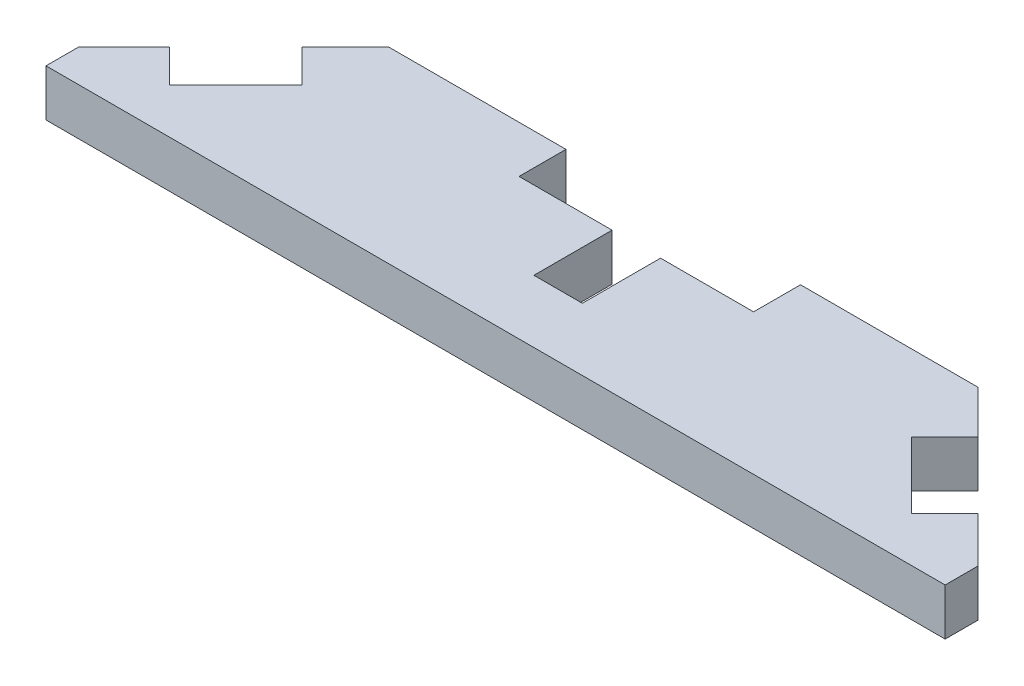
ISO-10303-21;
HEADER;
FILE_DESCRIPTION(('STEP AP214'),'2;1');
FILE_NAME('part.step','',(''),(''),'','','');
FILE_SCHEMA(('AUTOMOTIVE_DESIGN { 1 0 10303 214 1 1 1 1 }'));
ENDSEC;
DATA;
#1=APPLICATION_CONTEXT('core data for automotive mechanical design processes');
#2=APPLICATION_PROTOCOL_DEFINITION('international standard','automotive_design',2000,#1);
#3=PRODUCT_CONTEXT('',#1,'mechanical');
#4=PRODUCT('Part','Part','',(#3));
#5=PRODUCT_RELATED_PRODUCT_CATEGORY('part','',(#4));
#6=PRODUCT_DEFINITION_FORMATION('','',#4);
#7=PRODUCT_DEFINITION_CONTEXT('part definition',#1,'design');
#8=PRODUCT_DEFINITION('design','',#6,#7);
#9=PRODUCT_DEFINITION_SHAPE('','',#8);
#10=(LENGTH_UNIT() NAMED_UNIT(*) SI_UNIT(.MILLI.,.METRE.));
#11=(NAMED_UNIT(*) PLANE_ANGLE_UNIT() SI_UNIT($,.RADIAN.));
#12=(NAMED_UNIT(*) SI_UNIT($,.STERADIAN.) SOLID_ANGLE_UNIT());
#13=UNCERTAINTY_MEASURE_WITH_UNIT(LENGTH_MEASURE(1.E-05),#10,'distance_accuracy_value','');
#14=(GEOMETRIC_REPRESENTATION_CONTEXT(3) GLOBAL_UNCERTAINTY_ASSIGNED_CONTEXT((#13)) GLOBAL_UNIT_ASSIGNED_CONTEXT((#10,
#11,#12)) REPRESENTATION_CONTEXT('',''));
#15=CARTESIAN_POINT('',(0.,0.,0.));
#16=DIRECTION('',(0.,0.,1.));
#17=DIRECTION('',(1.,0.,0.));
#18=AXIS2_PLACEMENT_3D('',#15,#16,#17);
#19=CARTESIAN_POINT('',(-1.97758476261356E-13,3.,-24.85));
#20=DIRECTION('',(0.,-1.,0.));
#21=DIRECTION('',(0.,0.,-1.));
#22=AXIS2_PLACEMENT_3D('',#19,#20,#21);
#23=PLANE('',#22);
#24=DIRECTION('',(0.,0.,1.));
#25=VECTOR('',#24,1.);
#26=CARTESIAN_POINT('',(28.7499999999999,3.,5.99999999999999));
#27=LINE('',#26,#25);
#28=CARTESIAN_POINT('',(28.7499999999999,3.,3.89999999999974));
#29=VERTEX_POINT('',#28);
#30=CARTESIAN_POINT('',(28.7499999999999,3.,5.99999999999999));
#31=VERTEX_POINT('',#30);
#32=EDGE_CURVE('E181',#29,#31,#27,.T.);
#33=ORIENTED_EDGE('',*,*,#32,.F.);
#34=DIRECTION('',(-0.707106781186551,0.,-0.707106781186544));
#35=VECTOR('',#34,1.);
#36=CARTESIAN_POINT('',(18.85,3.,-6.00000000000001));
#37=LINE('',#36,#35);
#38=CARTESIAN_POINT('',(25.8503571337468,3.,1.00035713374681));
#39=VERTEX_POINT('',#38);
#40=EDGE_CURVE('E297',#29,#39,#37,.T.);
#41=ORIENTED_EDGE('',*,*,#40,.T.);
#42=DIRECTION('',(0.707106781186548,0.,-0.707106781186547));
#43=VECTOR('',#42,1.);
#44=CARTESIAN_POINT('',(25.8503571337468,3.,1.00035713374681));
#45=LINE('',#44,#43);
#46=CARTESIAN_POINT('',(23.7290367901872,3.,3.12167747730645));
#47=VERTEX_POINT('',#46);
#48=EDGE_CURVE('E358',#47,#39,#45,.T.);
#49=ORIENTED_EDGE('',*,*,#48,.F.);
#50=DIRECTION('',(0.707106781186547,0.,0.707106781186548));
#51=VECTOR('',#50,1.);
#52=CARTESIAN_POINT('',(23.7290367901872,3.,3.12167747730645));
#53=LINE('',#52,#51);
#54=CARTESIAN_POINT('',(19.4863961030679,3.,-1.12096320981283));
#55=VERTEX_POINT('',#54);
#56=EDGE_CURVE('E364',#55,#47,#53,.T.);
#57=ORIENTED_EDGE('',*,*,#56,.F.);
#58=DIRECTION('',(-0.707106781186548,0.,0.707106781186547));
#59=VECTOR('',#58,1.);
#60=CARTESIAN_POINT('',(21.6077164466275,3.,-3.24228355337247));
#61=LINE('',#60,#59);
#62=CARTESIAN_POINT('',(21.6077164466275,3.,-3.24228355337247));
#63=VERTEX_POINT('',#62);
#64=EDGE_CURVE('E361',#63,#55,#61,.T.);
#65=ORIENTED_EDGE('',*,*,#64,.F.);
#66=CARTESIAN_POINT('',(18.85,3.,-6.00000000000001));
#67=VERTEX_POINT('',#66);
#68=EDGE_CURVE('E222',#63,#67,#37,.T.);
#69=ORIENTED_EDGE('',*,*,#68,.T.);
#70=DIRECTION('',(-1.,0.,0.));
#71=VECTOR('',#70,1.);
#72=CARTESIAN_POINT('',(-18.85,3.,-6.00000000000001));
#73=LINE('',#72,#71);
#74=CARTESIAN_POINT('',(7.5,3.,-6.00000000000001));
#75=VERTEX_POINT('',#74);
#76=EDGE_CURVE('E299',#67,#75,#73,.T.);
#77=ORIENTED_EDGE('',*,*,#76,.T.);
#78=DIRECTION('',(0.,0.,-1.));
#79=VECTOR('',#78,1.);
#80=CARTESIAN_POINT('',(7.5,3.,-3.00000000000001));
#81=LINE('',#80,#79);
#82=CARTESIAN_POINT('',(7.5,3.,-3.00000000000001));
#83=VERTEX_POINT('',#82);
#84=EDGE_CURVE('E245',#83,#75,#81,.T.);
#85=ORIENTED_EDGE('',*,*,#84,.F.);
#86=DIRECTION('',(1.,0.,0.));
#87=VECTOR('',#86,1.);
#88=CARTESIAN_POINT('',(-7.5,3.,-3.00000000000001));
#89=LINE('',#88,#87);
#90=CARTESIAN_POINT('',(1.55,3.,-3.00000000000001));
#91=VERTEX_POINT('',#90);
#92=EDGE_CURVE('E234',#91,#83,#89,.T.);
#93=ORIENTED_EDGE('',*,*,#92,.F.);
#94=DIRECTION('',(0.,0.,-1.));
#95=VECTOR('',#94,1.);
#96=CARTESIAN_POINT('',(1.55,3.,-24.85));
#97=LINE('',#96,#95);
#98=CARTESIAN_POINT('',(1.55,3.,1.99999999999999));
#99=VERTEX_POINT('',#98);
#100=EDGE_CURVE('E243',#99,#91,#97,.T.);
#101=ORIENTED_EDGE('',*,*,#100,.F.);
#102=DIRECTION('',(1.,0.,0.));
#103=VECTOR('',#102,1.);
#104=CARTESIAN_POINT('',(-1.97758476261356E-13,3.,1.99999999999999));
#105=LINE('',#104,#103);
#106=CARTESIAN_POINT('',(-1.55,3.,1.99999999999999));
#107=VERTEX_POINT('',#106);
#108=EDGE_CURVE('E355',#107,#99,#105,.T.);
#109=ORIENTED_EDGE('',*,*,#108,.F.);
#110=DIRECTION('',(0.,0.,1.));
#111=VECTOR('',#110,1.);
#112=CARTESIAN_POINT('',(-1.55,3.,-24.85));
#113=LINE('',#112,#111);
#114=CARTESIAN_POINT('',(-1.55,3.,-3.00000000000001));
#115=VERTEX_POINT('',#114);
#116=EDGE_CURVE('E352',#115,#107,#113,.T.);
#117=ORIENTED_EDGE('',*,*,#116,.F.);
#118=CARTESIAN_POINT('',(-7.5,3.,-3.00000000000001));
#119=VERTEX_POINT('',#118);
#120=EDGE_CURVE('E246',#119,#115,#89,.T.);
#121=ORIENTED_EDGE('',*,*,#120,.F.);
#122=DIRECTION('',(0.,0.,1.));
#123=VECTOR('',#122,1.);
#124=CARTESIAN_POINT('',(-7.5,3.,-3.00000000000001));
#125=LINE('',#124,#123);
#126=CARTESIAN_POINT('',(-7.5,3.,-6.00000000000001));
#127=VERTEX_POINT('',#126);
#128=EDGE_CURVE('E247',#127,#119,#125,.T.);
#129=ORIENTED_EDGE('',*,*,#128,.F.);
#130=CARTESIAN_POINT('',(-18.85,3.,-6.00000000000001));
#131=VERTEX_POINT('',#130);
#132=EDGE_CURVE('E298',#127,#131,#73,.T.);
#133=ORIENTED_EDGE('',*,*,#132,.T.);
#134=DIRECTION('',(-0.707106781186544,0.,0.707106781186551));
#135=VECTOR('',#134,1.);
#136=CARTESIAN_POINT('',(-18.85,3.,-6.00000000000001));
#137=LINE('',#136,#135);
#138=CARTESIAN_POINT('',(-21.6077164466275,3.,-3.24228355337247));
#139=VERTEX_POINT('',#138);
#140=EDGE_CURVE('E201',#131,#139,#137,.T.);
#141=ORIENTED_EDGE('',*,*,#140,.T.);
#142=DIRECTION('',(-0.707106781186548,0.,-0.707106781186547));
#143=VECTOR('',#142,1.);
#144=CARTESIAN_POINT('',(-21.6077164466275,3.,-3.24228355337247));
#145=LINE('',#144,#143);
#146=CARTESIAN_POINT('',(-19.4863961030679,3.,-1.12096320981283));
#147=VERTEX_POINT('',#146);
#148=EDGE_CURVE('E278',#147,#139,#145,.T.);
#149=ORIENTED_EDGE('',*,*,#148,.F.);
#150=DIRECTION('',(0.707106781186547,0.,-0.707106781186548));
#151=VECTOR('',#150,1.);
#152=CARTESIAN_POINT('',(-23.7290367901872,3.,3.12167747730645));
#153=LINE('',#152,#151);
#154=CARTESIAN_POINT('',(-23.7290367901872,3.,3.12167747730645));
#155=VERTEX_POINT('',#154);
#156=EDGE_CURVE('E275',#155,#147,#153,.T.);
#157=ORIENTED_EDGE('',*,*,#156,.F.);
#158=DIRECTION('',(0.707106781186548,0.,0.707106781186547));
#159=VECTOR('',#158,1.);
#160=CARTESIAN_POINT('',(-25.8503571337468,3.,1.00035713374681));
#161=LINE('',#160,#159);
#162=CARTESIAN_POINT('',(-25.8503571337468,3.,1.00035713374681));
#163=VERTEX_POINT('',#162);
#164=EDGE_CURVE('E273',#163,#155,#161,.T.);
#165=ORIENTED_EDGE('',*,*,#164,.F.);
#166=CARTESIAN_POINT('',(-28.7499999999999,3.,3.89999999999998));
#167=VERTEX_POINT('',#166);
#168=EDGE_CURVE('E207',#163,#167,#137,.T.);
#169=ORIENTED_EDGE('',*,*,#168,.T.);
#170=DIRECTION('',(0.,0.,-1.));
#171=VECTOR('',#170,1.);
#172=CARTESIAN_POINT('',(-28.7499999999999,3.,6.));
#173=LINE('',#172,#171);
#174=CARTESIAN_POINT('',(-28.7499999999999,3.,6.));
#175=VERTEX_POINT('',#174);
#176=EDGE_CURVE('E199',#175,#167,#173,.T.);
#177=ORIENTED_EDGE('',*,*,#176,.F.);
#178=DIRECTION('',(1.,0.,0.));
#179=VECTOR('',#178,1.);
#180=CARTESIAN_POINT('',(-29.9499999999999,3.,6.));
#181=LINE('',#180,#179);
#182=EDGE_CURVE('E193',#175,#31,#181,.T.);
#183=ORIENTED_EDGE('',*,*,#182,.T.);
#184=EDGE_LOOP('',(#33,#41,#49,#57,#65,#69,#77,#85,#93,#101,#109,#117,#121,#129,#133,#141,#149,
#157,#165,#169,#177,#183));
#185=FACE_BOUND('',#184,.T.);
#186=ADVANCED_FACE('F35',(#185),#23,.F.);
#187=CARTESIAN_POINT('',(-1.97758476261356E-13,0.,-24.85));
#188=DIRECTION('',(0.,-1.,0.));
#189=DIRECTION('',(0.,0.,-1.));
#190=AXIS2_PLACEMENT_3D('',#187,#188,#189);
#191=PLANE('',#190);
#192=DIRECTION('',(-0.707106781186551,0.,-0.707106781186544));
#193=VECTOR('',#192,1.);
#194=CARTESIAN_POINT('',(18.85,0.,-6.00000000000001));
#195=LINE('',#194,#193);
#196=CARTESIAN_POINT('',(28.7499999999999,0.,3.89999999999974));
#197=VERTEX_POINT('',#196);
#198=CARTESIAN_POINT('',(25.8503571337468,0.,1.00035713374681));
#199=VERTEX_POINT('',#198);
#200=EDGE_CURVE('E211',#197,#199,#195,.T.);
#201=ORIENTED_EDGE('',*,*,#200,.F.);
#202=DIRECTION('',(0.,0.,1.));
#203=VECTOR('',#202,1.);
#204=CARTESIAN_POINT('',(28.7499999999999,0.,5.99999999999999));
#205=LINE('',#204,#203);
#206=CARTESIAN_POINT('',(28.7499999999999,0.,5.99999999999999));
#207=VERTEX_POINT('',#206);
#208=EDGE_CURVE('E49',#197,#207,#205,.T.);
#209=ORIENTED_EDGE('',*,*,#208,.T.);
#210=DIRECTION('',(1.,0.,0.));
#211=VECTOR('',#210,1.);
#212=CARTESIAN_POINT('',(29.9500000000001,0.,6.));
#213=LINE('',#212,#211);
#214=CARTESIAN_POINT('',(-28.7499999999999,0.,5.99999999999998));
#215=VERTEX_POINT('',#214);
#216=EDGE_CURVE('E195',#215,#207,#213,.T.);
#217=ORIENTED_EDGE('',*,*,#216,.F.);
#218=DIRECTION('',(0.,0.,-1.));
#219=VECTOR('',#218,1.);
#220=CARTESIAN_POINT('',(-28.7499999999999,0.,6.));
#221=LINE('',#220,#219);
#222=CARTESIAN_POINT('',(-28.7499999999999,0.,3.89999999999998));
#223=VERTEX_POINT('',#222);
#224=EDGE_CURVE('E57',#215,#223,#221,.T.);
#225=ORIENTED_EDGE('',*,*,#224,.T.);
#226=DIRECTION('',(-0.707106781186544,0.,0.707106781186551));
#227=VECTOR('',#226,1.);
#228=CARTESIAN_POINT('',(-18.85,0.,-6.00000000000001));
#229=LINE('',#228,#227);
#230=CARTESIAN_POINT('',(-25.8503571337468,0.,1.00035713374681));
#231=VERTEX_POINT('',#230);
#232=EDGE_CURVE('E218',#231,#223,#229,.T.);
#233=ORIENTED_EDGE('',*,*,#232,.F.);
#234=DIRECTION('',(0.707106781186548,0.,0.707106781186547));
#235=VECTOR('',#234,1.);
#236=CARTESIAN_POINT('',(-25.8503571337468,0.,1.00035713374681));
#237=LINE('',#236,#235);
#238=CARTESIAN_POINT('',(-23.7290367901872,0.,3.12167747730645));
#239=VERTEX_POINT('',#238);
#240=EDGE_CURVE('E272',#231,#239,#237,.T.);
#241=ORIENTED_EDGE('',*,*,#240,.T.);
#242=DIRECTION('',(0.707106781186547,0.,-0.707106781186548));
#243=VECTOR('',#242,1.);
#244=CARTESIAN_POINT('',(-23.7290367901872,0.,3.12167747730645));
#245=LINE('',#244,#243);
#246=CARTESIAN_POINT('',(-19.4863961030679,0.,-1.12096320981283));
#247=VERTEX_POINT('',#246);
#248=EDGE_CURVE('E283',#239,#247,#245,.T.);
#249=ORIENTED_EDGE('',*,*,#248,.T.);
#250=DIRECTION('',(-0.707106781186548,0.,-0.707106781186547));
#251=VECTOR('',#250,1.);
#252=CARTESIAN_POINT('',(-21.6077164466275,0.,-3.24228355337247));
#253=LINE('',#252,#251);
#254=CARTESIAN_POINT('',(-21.6077164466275,0.,-3.24228355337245));
#255=VERTEX_POINT('',#254);
#256=EDGE_CURVE('E276',#247,#255,#253,.T.);
#257=ORIENTED_EDGE('',*,*,#256,.T.);
#258=CARTESIAN_POINT('',(-18.85,0.,-6.00000000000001));
#259=VERTEX_POINT('',#258);
#260=EDGE_CURVE('E219',#259,#255,#229,.T.);
#261=ORIENTED_EDGE('',*,*,#260,.F.);
#262=DIRECTION('',(-1.,0.,0.));
#263=VECTOR('',#262,1.);
#264=CARTESIAN_POINT('',(-18.85,0.,-6.00000000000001));
#265=LINE('',#264,#263);
#266=CARTESIAN_POINT('',(-7.5,0.,-6.00000000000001));
#267=VERTEX_POINT('',#266);
#268=EDGE_CURVE('E213',#267,#259,#265,.T.);
#269=ORIENTED_EDGE('',*,*,#268,.F.);
#270=DIRECTION('',(0.,0.,1.));
#271=VECTOR('',#270,1.);
#272=CARTESIAN_POINT('',(-7.5,0.,-3.00000000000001));
#273=LINE('',#272,#271);
#274=CARTESIAN_POINT('',(-7.5,0.,-3.00000000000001));
#275=VERTEX_POINT('',#274);
#276=EDGE_CURVE('E257',#267,#275,#273,.T.);
#277=ORIENTED_EDGE('',*,*,#276,.T.);
#278=DIRECTION('',(1.,0.,0.));
#279=VECTOR('',#278,1.);
#280=CARTESIAN_POINT('',(-7.5,0.,-3.00000000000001));
#281=LINE('',#280,#279);
#282=CARTESIAN_POINT('',(-1.55,0.,-3.00000000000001));
#283=VERTEX_POINT('',#282);
#284=EDGE_CURVE('E261',#275,#283,#281,.T.);
#285=ORIENTED_EDGE('',*,*,#284,.T.);
#286=DIRECTION('',(0.,0.,1.));
#287=VECTOR('',#286,1.);
#288=CARTESIAN_POINT('',(-1.55,0.,1.99999999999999));
#289=LINE('',#288,#287);
#290=CARTESIAN_POINT('',(-1.55,0.,1.99999999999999));
#291=VERTEX_POINT('',#290);
#292=EDGE_CURVE('E338',#283,#291,#289,.T.);
#293=ORIENTED_EDGE('',*,*,#292,.T.);
#294=DIRECTION('',(1.,0.,0.));
#295=VECTOR('',#294,1.);
#296=CARTESIAN_POINT('',(-1.55,0.,1.99999999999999));
#297=LINE('',#296,#295);
#298=CARTESIAN_POINT('',(1.55,0.,1.99999999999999));
#299=VERTEX_POINT('',#298);
#300=EDGE_CURVE('E345',#291,#299,#297,.T.);
#301=ORIENTED_EDGE('',*,*,#300,.T.);
#302=DIRECTION('',(0.,0.,-1.));
#303=VECTOR('',#302,1.);
#304=CARTESIAN_POINT('',(1.55,0.,1.99999999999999));
#305=LINE('',#304,#303);
#306=CARTESIAN_POINT('',(1.55,0.,-3.00000000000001));
#307=VERTEX_POINT('',#306);
#308=EDGE_CURVE('E335',#299,#307,#305,.T.);
#309=ORIENTED_EDGE('',*,*,#308,.T.);
#310=CARTESIAN_POINT('',(7.5,0.,-3.00000000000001));
#311=VERTEX_POINT('',#310);
#312=EDGE_CURVE('E236',#307,#311,#281,.T.);
#313=ORIENTED_EDGE('',*,*,#312,.T.);
#314=DIRECTION('',(0.,0.,-1.));
#315=VECTOR('',#314,1.);
#316=CARTESIAN_POINT('',(7.5,0.,-3.00000000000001));
#317=LINE('',#316,#315);
#318=CARTESIAN_POINT('',(7.5,0.,-6.00000000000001));
#319=VERTEX_POINT('',#318);
#320=EDGE_CURVE('E254',#311,#319,#317,.T.);
#321=ORIENTED_EDGE('',*,*,#320,.T.);
#322=CARTESIAN_POINT('',(18.85,0.,-6.00000000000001));
#323=VERTEX_POINT('',#322);
#324=EDGE_CURVE('E215',#323,#319,#265,.T.);
#325=ORIENTED_EDGE('',*,*,#324,.F.);
#326=CARTESIAN_POINT('',(21.6077164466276,0.,-3.24228355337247));
#327=VERTEX_POINT('',#326);
#328=EDGE_CURVE('E214',#327,#323,#195,.T.);
#329=ORIENTED_EDGE('',*,*,#328,.F.);
#330=DIRECTION('',(-0.707106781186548,0.,0.707106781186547));
#331=VECTOR('',#330,1.);
#332=CARTESIAN_POINT('',(21.6077164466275,0.,-3.24228355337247));
#333=LINE('',#332,#331);
#334=CARTESIAN_POINT('',(19.4863961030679,0.,-1.12096320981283));
#335=VERTEX_POINT('',#334);
#336=EDGE_CURVE('E369',#327,#335,#333,.T.);
#337=ORIENTED_EDGE('',*,*,#336,.T.);
#338=DIRECTION('',(0.707106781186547,0.,0.707106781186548));
#339=VECTOR('',#338,1.);
#340=CARTESIAN_POINT('',(23.7290367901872,0.,3.12167747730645));
#341=LINE('',#340,#339);
#342=CARTESIAN_POINT('',(23.7290367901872,0.,3.12167747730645));
#343=VERTEX_POINT('',#342);
#344=EDGE_CURVE('E362',#335,#343,#341,.T.);
#345=ORIENTED_EDGE('',*,*,#344,.T.);
#346=DIRECTION('',(0.707106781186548,0.,-0.707106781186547));
#347=VECTOR('',#346,1.);
#348=CARTESIAN_POINT('',(25.8503571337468,0.,1.00035713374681));
#349=LINE('',#348,#347);
#350=EDGE_CURVE('E357',#343,#199,#349,.T.);
#351=ORIENTED_EDGE('',*,*,#350,.T.);
#352=EDGE_LOOP('',(#201,#209,#217,#225,#233,#241,#249,#257,#261,#269,#277,#285,#293,#301,#309,
#313,#321,#325,#329,#337,#345,#351));
#353=FACE_BOUND('',#352,.T.);
#354=ADVANCED_FACE('F320',(#353),#191,.T.);
#355=CARTESIAN_POINT('',(29.9500000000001,3.,6.));
#356=DIRECTION('',(0.,0.,-1.));
#357=DIRECTION('',(-1.,0.,0.));
#358=AXIS2_PLACEMENT_3D('',#355,#356,#357);
#359=PLANE('',#358);
#360=DIRECTION('',(0.,-1.,0.));
#361=VECTOR('',#360,1.);
#362=CARTESIAN_POINT('',(28.7499999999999,3.,5.99999999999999));
#363=LINE('',#362,#361);
#364=EDGE_CURVE('E184',#31,#207,#363,.T.);
#365=ORIENTED_EDGE('',*,*,#364,.F.);
#366=ORIENTED_EDGE('',*,*,#182,.F.);
#367=DIRECTION('',(0.,-1.,0.));
#368=VECTOR('',#367,1.);
#369=CARTESIAN_POINT('',(-28.7499999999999,3.,6.));
#370=LINE('',#369,#368);
#371=EDGE_CURVE('E336',#175,#215,#370,.T.);
#372=ORIENTED_EDGE('',*,*,#371,.T.);
#373=ORIENTED_EDGE('',*,*,#216,.T.);
#374=EDGE_LOOP('',(#365,#366,#372,#373));
#375=FACE_BOUND('',#374,.T.);
#376=ADVANCED_FACE('F192',(#375),#359,.F.);
#377=CARTESIAN_POINT('',(18.85,3.,-6.00000000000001));
#378=DIRECTION('',(-0.707106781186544,0.,0.707106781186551));
#379=DIRECTION('',(0.707106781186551,0.,0.707106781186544));
#380=AXIS2_PLACEMENT_3D('',#377,#378,#379);
#381=PLANE('',#380);
#382=DIRECTION('',(0.,1.,0.));
#383=VECTOR('',#382,1.);
#384=CARTESIAN_POINT('',(28.7499999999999,3.,3.89999999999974));
#385=LINE('',#384,#383);
#386=EDGE_CURVE('E11',#197,#29,#385,.T.);
#387=ORIENTED_EDGE('',*,*,#386,.F.);
#388=ORIENTED_EDGE('',*,*,#200,.T.);
#389=DIRECTION('',(0.,-1.,0.));
#390=VECTOR('',#389,1.);
#391=CARTESIAN_POINT('',(25.8503571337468,3.,1.00035713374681));
#392=LINE('',#391,#390);
#393=EDGE_CURVE('E258',#39,#199,#392,.T.);
#394=ORIENTED_EDGE('',*,*,#393,.F.);
#395=ORIENTED_EDGE('',*,*,#40,.F.);
#396=EDGE_LOOP('',(#387,#388,#394,#395));
#397=FACE_BOUND('',#396,.T.);
#398=ADVANCED_FACE('F37',(#397),#381,.F.);
#399=CARTESIAN_POINT('',(-18.85,3.,-6.00000000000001));
#400=DIRECTION('',(0.707106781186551,0.,0.707106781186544));
#401=DIRECTION('',(0.707106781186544,0.,-0.707106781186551));
#402=AXIS2_PLACEMENT_3D('',#399,#400,#401);
#403=PLANE('',#402);
#404=DIRECTION('',(0.,-1.,0.));
#405=VECTOR('',#404,1.);
#406=CARTESIAN_POINT('',(-28.7499999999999,3.,3.89999999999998));
#407=LINE('',#406,#405);
#408=EDGE_CURVE('E334',#167,#223,#407,.T.);
#409=ORIENTED_EDGE('',*,*,#408,.F.);
#410=ORIENTED_EDGE('',*,*,#168,.F.);
#411=DIRECTION('',(0.,-1.,0.));
#412=VECTOR('',#411,1.);
#413=CARTESIAN_POINT('',(-25.8503571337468,3.,1.00035713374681));
#414=LINE('',#413,#412);
#415=EDGE_CURVE('E280',#163,#231,#414,.T.);
#416=ORIENTED_EDGE('',*,*,#415,.T.);
#417=ORIENTED_EDGE('',*,*,#232,.T.);
#418=EDGE_LOOP('',(#409,#410,#416,#417));
#419=FACE_BOUND('',#418,.T.);
#420=ADVANCED_FACE('F332',(#419),#403,.F.);
#421=CARTESIAN_POINT('',(-7.5,3.,-3.00000000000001));
#422=DIRECTION('',(0.,0.,-1.));
#423=DIRECTION('',(-1.,0.,0.));
#424=AXIS2_PLACEMENT_3D('',#421,#422,#423);
#425=PLANE('',#424);
#426=ORIENTED_EDGE('',*,*,#312,.F.);
#427=DIRECTION('',(0.,1.,0.));
#428=VECTOR('',#427,1.);
#429=CARTESIAN_POINT('',(1.55,3.,-3.00000000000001));
#430=LINE('',#429,#428);
#431=EDGE_CURVE('E43',#307,#91,#430,.T.);
#432=ORIENTED_EDGE('',*,*,#431,.T.);
#433=ORIENTED_EDGE('',*,*,#92,.T.);
#434=DIRECTION('',(0.,-1.,0.));
#435=VECTOR('',#434,1.);
#436=CARTESIAN_POINT('',(7.5,3.,-3.00000000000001));
#437=LINE('',#436,#435);
#438=EDGE_CURVE('E250',#83,#311,#437,.T.);
#439=ORIENTED_EDGE('',*,*,#438,.T.);
#440=EDGE_LOOP('',(#426,#432,#433,#439));
#441=FACE_BOUND('',#440,.T.);
#442=ADVANCED_FACE('F232',(#441),#425,.T.);
#443=ORIENTED_EDGE('',*,*,#120,.T.);
#444=DIRECTION('',(0.,-1.,0.));
#445=VECTOR('',#444,1.);
#446=CARTESIAN_POINT('',(-1.55,3.,-3.00000000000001));
#447=LINE('',#446,#445);
#448=EDGE_CURVE('E226',#115,#283,#447,.T.);
#449=ORIENTED_EDGE('',*,*,#448,.T.);
#450=ORIENTED_EDGE('',*,*,#284,.F.);
#451=DIRECTION('',(0.,-1.,0.));
#452=VECTOR('',#451,1.);
#453=CARTESIAN_POINT('',(-7.5,3.,-3.00000000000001));
#454=LINE('',#453,#452);
#455=EDGE_CURVE('E265',#119,#275,#454,.T.);
#456=ORIENTED_EDGE('',*,*,#455,.F.);
#457=EDGE_LOOP('',(#443,#449,#450,#456));
#458=FACE_BOUND('',#457,.T.);
#459=ADVANCED_FACE('F400',(#458),#425,.T.);
#460=DIRECTION('',(0.,-1.,0.));
#461=VECTOR('',#460,1.);
#462=CARTESIAN_POINT('',(21.6077164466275,3.,-3.24228355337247));
#463=LINE('',#462,#461);
#464=EDGE_CURVE('E377',#63,#327,#463,.T.);
#465=ORIENTED_EDGE('',*,*,#464,.T.);
#466=ORIENTED_EDGE('',*,*,#328,.T.);
#467=DIRECTION('',(0.,-1.,0.));
#468=VECTOR('',#467,1.);
#469=CARTESIAN_POINT('',(18.85,3.,-6.00000000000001));
#470=LINE('',#469,#468);
#471=EDGE_CURVE('E204',#67,#323,#470,.T.);
#472=ORIENTED_EDGE('',*,*,#471,.F.);
#473=ORIENTED_EDGE('',*,*,#68,.F.);
#474=EDGE_LOOP('',(#465,#466,#472,#473));
#475=FACE_BOUND('',#474,.T.);
#476=ADVANCED_FACE('F429',(#475),#381,.F.);
#477=CARTESIAN_POINT('',(-18.85,3.,-6.00000000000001));
#478=DIRECTION('',(0.,0.,1.));
#479=DIRECTION('',(1.,0.,0.));
#480=AXIS2_PLACEMENT_3D('',#477,#478,#479);
#481=PLANE('',#480);
#482=DIRECTION('',(0.,-1.,0.));
#483=VECTOR('',#482,1.);
#484=CARTESIAN_POINT('',(7.5,3.,-6.00000000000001));
#485=LINE('',#484,#483);
#486=EDGE_CURVE('E270',#75,#319,#485,.T.);
#487=ORIENTED_EDGE('',*,*,#486,.F.);
#488=ORIENTED_EDGE('',*,*,#76,.F.);
#489=ORIENTED_EDGE('',*,*,#471,.T.);
#490=ORIENTED_EDGE('',*,*,#324,.T.);
#491=EDGE_LOOP('',(#487,#488,#489,#490));
#492=FACE_BOUND('',#491,.T.);
#493=ADVANCED_FACE('F386',(#492),#481,.F.);
#494=DIRECTION('',(0.,-1.,0.));
#495=VECTOR('',#494,1.);
#496=CARTESIAN_POINT('',(-7.5,3.,-6.00000000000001));
#497=LINE('',#496,#495);
#498=EDGE_CURVE('E267',#127,#267,#497,.T.);
#499=ORIENTED_EDGE('',*,*,#498,.T.);
#500=ORIENTED_EDGE('',*,*,#268,.T.);
#501=DIRECTION('',(0.,-1.,0.));
#502=VECTOR('',#501,1.);
#503=CARTESIAN_POINT('',(-18.85,3.,-6.00000000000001));
#504=LINE('',#503,#502);
#505=EDGE_CURVE('E200',#131,#259,#504,.T.);
#506=ORIENTED_EDGE('',*,*,#505,.F.);
#507=ORIENTED_EDGE('',*,*,#132,.F.);
#508=EDGE_LOOP('',(#499,#500,#506,#507));
#509=FACE_BOUND('',#508,.T.);
#510=ADVANCED_FACE('F308',(#509),#481,.F.);
#511=DIRECTION('',(0.,-1.,0.));
#512=VECTOR('',#511,1.);
#513=CARTESIAN_POINT('',(-21.6077164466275,3.,-3.24228355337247));
#514=LINE('',#513,#512);
#515=EDGE_CURVE('E290',#139,#255,#514,.T.);
#516=ORIENTED_EDGE('',*,*,#515,.F.);
#517=ORIENTED_EDGE('',*,*,#140,.F.);
#518=ORIENTED_EDGE('',*,*,#505,.T.);
#519=ORIENTED_EDGE('',*,*,#260,.T.);
#520=EDGE_LOOP('',(#516,#517,#518,#519));
#521=FACE_BOUND('',#520,.T.);
#522=ADVANCED_FACE('F313',(#521),#403,.F.);
#523=CARTESIAN_POINT('',(-25.8503571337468,3.,1.00035713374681));
#524=DIRECTION('',(0.707106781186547,0.,-0.707106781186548));
#525=DIRECTION('',(-0.707106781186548,0.,-0.707106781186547));
#526=AXIS2_PLACEMENT_3D('',#523,#524,#525);
#527=PLANE('',#526);
#528=ORIENTED_EDGE('',*,*,#240,.F.);
#529=ORIENTED_EDGE('',*,*,#415,.F.);
#530=ORIENTED_EDGE('',*,*,#164,.T.);
#531=DIRECTION('',(0.,-1.,0.));
#532=VECTOR('',#531,1.);
#533=CARTESIAN_POINT('',(-23.7290367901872,3.,3.12167747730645));
#534=LINE('',#533,#532);
#535=EDGE_CURVE('E294',#155,#239,#534,.T.);
#536=ORIENTED_EDGE('',*,*,#535,.T.);
#537=EDGE_LOOP('',(#528,#529,#530,#536));
#538=FACE_BOUND('',#537,.T.);
#539=ADVANCED_FACE('F327',(#538),#527,.T.);
#540=CARTESIAN_POINT('',(-23.7290367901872,3.,3.12167747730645));
#541=DIRECTION('',(-0.707106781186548,0.,-0.707106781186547));
#542=DIRECTION('',(-0.707106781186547,0.,0.707106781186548));
#543=AXIS2_PLACEMENT_3D('',#540,#541,#542);
#544=PLANE('',#543);
#545=ORIENTED_EDGE('',*,*,#248,.F.);
#546=ORIENTED_EDGE('',*,*,#535,.F.);
#547=ORIENTED_EDGE('',*,*,#156,.T.);
#548=DIRECTION('',(0.,-1.,0.));
#549=VECTOR('',#548,1.);
#550=CARTESIAN_POINT('',(-19.4863961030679,3.,-1.12096320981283));
#551=LINE('',#550,#549);
#552=EDGE_CURVE('E292',#147,#247,#551,.T.);
#553=ORIENTED_EDGE('',*,*,#552,.T.);
#554=EDGE_LOOP('',(#545,#546,#547,#553));
#555=FACE_BOUND('',#554,.T.);
#556=ADVANCED_FACE('F324',(#555),#544,.T.);
#557=CARTESIAN_POINT('',(-21.6077164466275,3.,-3.24228355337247));
#558=DIRECTION('',(-0.707106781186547,0.,0.707106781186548));
#559=DIRECTION('',(0.707106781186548,0.,0.707106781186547));
#560=AXIS2_PLACEMENT_3D('',#557,#558,#559);
#561=PLANE('',#560);
#562=ORIENTED_EDGE('',*,*,#256,.F.);
#563=ORIENTED_EDGE('',*,*,#552,.F.);
#564=ORIENTED_EDGE('',*,*,#148,.T.);
#565=ORIENTED_EDGE('',*,*,#515,.T.);
#566=EDGE_LOOP('',(#562,#563,#564,#565));
#567=FACE_BOUND('',#566,.T.);
#568=ADVANCED_FACE('F316',(#567),#561,.T.);
#569=CARTESIAN_POINT('',(7.5,3.,-3.00000000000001));
#570=DIRECTION('',(-1.,0.,0.));
#571=DIRECTION('',(0.,0.,1.));
#572=AXIS2_PLACEMENT_3D('',#569,#570,#571);
#573=PLANE('',#572);
#574=ORIENTED_EDGE('',*,*,#320,.F.);
#575=ORIENTED_EDGE('',*,*,#438,.F.);
#576=ORIENTED_EDGE('',*,*,#84,.T.);
#577=ORIENTED_EDGE('',*,*,#486,.T.);
#578=EDGE_LOOP('',(#574,#575,#576,#577));
#579=FACE_BOUND('',#578,.T.);
#580=ADVANCED_FACE('F384',(#579),#573,.T.);
#581=CARTESIAN_POINT('',(-7.5,3.,-3.00000000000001));
#582=DIRECTION('',(1.,0.,0.));
#583=DIRECTION('',(0.,0.,-1.));
#584=AXIS2_PLACEMENT_3D('',#581,#582,#583);
#585=PLANE('',#584);
#586=ORIENTED_EDGE('',*,*,#276,.F.);
#587=ORIENTED_EDGE('',*,*,#498,.F.);
#588=ORIENTED_EDGE('',*,*,#128,.T.);
#589=ORIENTED_EDGE('',*,*,#455,.T.);
#590=EDGE_LOOP('',(#586,#587,#588,#589));
#591=FACE_BOUND('',#590,.T.);
#592=ADVANCED_FACE('F403',(#591),#585,.T.);
#593=CARTESIAN_POINT('',(25.8503571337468,3.,1.00035713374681));
#594=DIRECTION('',(-0.707106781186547,0.,-0.707106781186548));
#595=DIRECTION('',(-0.707106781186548,0.,0.707106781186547));
#596=AXIS2_PLACEMENT_3D('',#593,#594,#595);
#597=PLANE('',#596);
#598=ORIENTED_EDGE('',*,*,#350,.F.);
#599=DIRECTION('',(0.,-1.,0.));
#600=VECTOR('',#599,1.);
#601=CARTESIAN_POINT('',(23.7290367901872,3.,3.12167747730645));
#602=LINE('',#601,#600);
#603=EDGE_CURVE('E366',#47,#343,#602,.T.);
#604=ORIENTED_EDGE('',*,*,#603,.F.);
#605=ORIENTED_EDGE('',*,*,#48,.T.);
#606=ORIENTED_EDGE('',*,*,#393,.T.);
#607=EDGE_LOOP('',(#598,#604,#605,#606));
#608=FACE_BOUND('',#607,.T.);
#609=ADVANCED_FACE('F448',(#608),#597,.T.);
#610=CARTESIAN_POINT('',(21.6077164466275,3.,-3.24228355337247));
#611=DIRECTION('',(0.707106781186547,0.,0.707106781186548));
#612=DIRECTION('',(0.707106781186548,0.,-0.707106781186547));
#613=AXIS2_PLACEMENT_3D('',#610,#611,#612);
#614=PLANE('',#613);
#615=ORIENTED_EDGE('',*,*,#336,.F.);
#616=ORIENTED_EDGE('',*,*,#464,.F.);
#617=ORIENTED_EDGE('',*,*,#64,.T.);
#618=DIRECTION('',(0.,-1.,0.));
#619=VECTOR('',#618,1.);
#620=CARTESIAN_POINT('',(19.4863961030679,3.,-1.12096320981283));
#621=LINE('',#620,#619);
#622=EDGE_CURVE('E375',#55,#335,#621,.T.);
#623=ORIENTED_EDGE('',*,*,#622,.T.);
#624=EDGE_LOOP('',(#615,#616,#617,#623));
#625=FACE_BOUND('',#624,.T.);
#626=ADVANCED_FACE('F457',(#625),#614,.T.);
#627=CARTESIAN_POINT('',(23.7290367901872,3.,3.12167747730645));
#628=DIRECTION('',(0.707106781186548,0.,-0.707106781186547));
#629=DIRECTION('',(-0.707106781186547,0.,-0.707106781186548));
#630=AXIS2_PLACEMENT_3D('',#627,#628,#629);
#631=PLANE('',#630);
#632=ORIENTED_EDGE('',*,*,#344,.F.);
#633=ORIENTED_EDGE('',*,*,#622,.F.);
#634=ORIENTED_EDGE('',*,*,#56,.T.);
#635=ORIENTED_EDGE('',*,*,#603,.T.);
#636=EDGE_LOOP('',(#632,#633,#634,#635));
#637=FACE_BOUND('',#636,.T.);
#638=ADVANCED_FACE('F455',(#637),#631,.T.);
#639=CARTESIAN_POINT('',(-1.55,10.,1.99999999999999));
#640=DIRECTION('',(0.,0.,-1.));
#641=DIRECTION('',(-1.,0.,0.));
#642=AXIS2_PLACEMENT_3D('',#639,#640,#641);
#643=PLANE('',#642);
#644=ORIENTED_EDGE('',*,*,#108,.T.);
#645=DIRECTION('',(0.,-1.,0.));
#646=VECTOR('',#645,1.);
#647=CARTESIAN_POINT('',(1.55,10.,1.99999999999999));
#648=LINE('',#647,#646);
#649=EDGE_CURVE('E348',#99,#299,#648,.T.);
#650=ORIENTED_EDGE('',*,*,#649,.T.);
#651=ORIENTED_EDGE('',*,*,#300,.F.);
#652=DIRECTION('',(0.,-1.,0.));
#653=VECTOR('',#652,1.);
#654=CARTESIAN_POINT('',(-1.55,10.,1.99999999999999));
#655=LINE('',#654,#653);
#656=EDGE_CURVE('E350',#107,#291,#655,.T.);
#657=ORIENTED_EDGE('',*,*,#656,.F.);
#658=EDGE_LOOP('',(#644,#650,#651,#657));
#659=FACE_BOUND('',#658,.T.);
#660=ADVANCED_FACE('F394',(#659),#643,.T.);
#661=CARTESIAN_POINT('',(1.55,10.,1.99999999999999));
#662=DIRECTION('',(-1.,0.,0.));
#663=DIRECTION('',(0.,0.,1.));
#664=AXIS2_PLACEMENT_3D('',#661,#662,#663);
#665=PLANE('',#664);
#666=ORIENTED_EDGE('',*,*,#100,.T.);
#667=ORIENTED_EDGE('',*,*,#431,.F.);
#668=ORIENTED_EDGE('',*,*,#308,.F.);
#669=ORIENTED_EDGE('',*,*,#649,.F.);
#670=EDGE_LOOP('',(#666,#667,#668,#669));
#671=FACE_BOUND('',#670,.T.);
#672=ADVANCED_FACE('F392',(#671),#665,.T.);
#673=CARTESIAN_POINT('',(-1.55,10.,1.99999999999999));
#674=DIRECTION('',(1.,0.,0.));
#675=DIRECTION('',(0.,0.,-1.));
#676=AXIS2_PLACEMENT_3D('',#673,#674,#675);
#677=PLANE('',#676);
#678=ORIENTED_EDGE('',*,*,#116,.T.);
#679=ORIENTED_EDGE('',*,*,#656,.T.);
#680=ORIENTED_EDGE('',*,*,#292,.F.);
#681=ORIENTED_EDGE('',*,*,#448,.F.);
#682=EDGE_LOOP('',(#678,#679,#680,#681));
#683=FACE_BOUND('',#682,.T.);
#684=ADVANCED_FACE('F404',(#683),#677,.T.);
#685=CARTESIAN_POINT('',(-28.7499999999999,3.,6.));
#686=DIRECTION('',(-1.,0.,0.));
#687=DIRECTION('',(0.,0.,1.));
#688=AXIS2_PLACEMENT_3D('',#685,#686,#687);
#689=PLANE('',#688);
#690=ORIENTED_EDGE('',*,*,#408,.T.);
#691=ORIENTED_EDGE('',*,*,#224,.F.);
#692=ORIENTED_EDGE('',*,*,#371,.F.);
#693=ORIENTED_EDGE('',*,*,#176,.T.);
#694=EDGE_LOOP('',(#690,#691,#692,#693));
#695=FACE_BOUND('',#694,.T.);
#696=ADVANCED_FACE('F406',(#695),#689,.T.);
#697=CARTESIAN_POINT('',(28.7499999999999,3.,5.99999999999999));
#698=DIRECTION('',(1.,0.,0.));
#699=DIRECTION('',(0.,0.,-1.));
#700=AXIS2_PLACEMENT_3D('',#697,#698,#699);
#701=PLANE('',#700);
#702=ORIENTED_EDGE('',*,*,#386,.T.);
#703=ORIENTED_EDGE('',*,*,#32,.T.);
#704=ORIENTED_EDGE('',*,*,#364,.T.);
#705=ORIENTED_EDGE('',*,*,#208,.F.);
#706=EDGE_LOOP('',(#702,#703,#704,#705));
#707=FACE_BOUND('',#706,.T.);
#708=ADVANCED_FACE('F183',(#707),#701,.T.);
#709=CLOSED_SHELL('',(#186,#354,#376,#398,#420,#442,#459,#476,#493,#510,#522,#539,#556,#568,
#580,#592,#609,#626,#638,#660,#672,#684,#696,#708));
#710=MANIFOLD_SOLID_BREP('B2',#709);
#711=ADVANCED_BREP_SHAPE_REPRESENTATION('',(#18,#710),#14);
#712=SHAPE_DEFINITION_REPRESENTATION(#9,#711);
ENDSEC;
END-ISO-10303-21;
